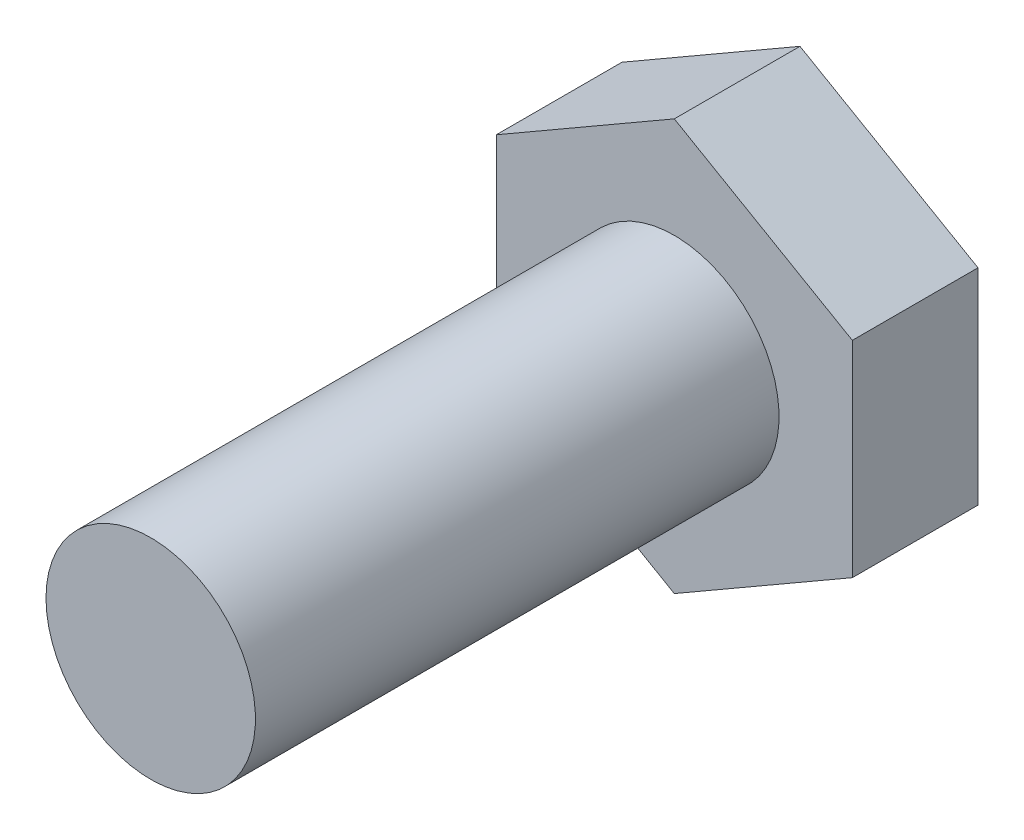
ISO-10303-21;
HEADER;
FILE_DESCRIPTION(('STEP AP214'),'2;1');
FILE_NAME('part.step','',(''),(''),'','','');
FILE_SCHEMA(('AUTOMOTIVE_DESIGN { 1 0 10303 214 1 1 1 1 }'));
ENDSEC;
DATA;
#1=APPLICATION_CONTEXT('core data for automotive mechanical design processes');
#2=APPLICATION_PROTOCOL_DEFINITION('international standard','automotive_design',2000,#1);
#3=PRODUCT_CONTEXT('',#1,'mechanical');
#4=PRODUCT('Part','Part','',(#3));
#5=PRODUCT_RELATED_PRODUCT_CATEGORY('part','',(#4));
#6=PRODUCT_DEFINITION_FORMATION('','',#4);
#7=PRODUCT_DEFINITION_CONTEXT('part definition',#1,'design');
#8=PRODUCT_DEFINITION('design','',#6,#7);
#9=PRODUCT_DEFINITION_SHAPE('','',#8);
#10=(LENGTH_UNIT() NAMED_UNIT(*) SI_UNIT(.MILLI.,.METRE.));
#11=(NAMED_UNIT(*) PLANE_ANGLE_UNIT() SI_UNIT($,.RADIAN.));
#12=(NAMED_UNIT(*) SI_UNIT($,.STERADIAN.) SOLID_ANGLE_UNIT());
#13=UNCERTAINTY_MEASURE_WITH_UNIT(LENGTH_MEASURE(1.E-05),#10,'distance_accuracy_value','');
#14=(GEOMETRIC_REPRESENTATION_CONTEXT(3) GLOBAL_UNCERTAINTY_ASSIGNED_CONTEXT((#13)) GLOBAL_UNIT_ASSIGNED_CONTEXT((#10,
#11,#12)) REPRESENTATION_CONTEXT('',''));
#15=CARTESIAN_POINT('',(0.,0.,0.));
#16=DIRECTION('',(0.,0.,1.));
#17=DIRECTION('',(1.,0.,0.));
#18=AXIS2_PLACEMENT_3D('',#15,#16,#17);
#19=CARTESIAN_POINT('',(0.,0.,32.5));
#20=DIRECTION('',(0.,0.,-1.));
#21=DIRECTION('',(-1.,0.,0.));
#22=AXIS2_PLACEMENT_3D('',#19,#20,#21);
#23=PLANE('',#22);
#24=CARTESIAN_POINT('',(0.,0.,32.5));
#25=DIRECTION('',(0.,0.,-1.));
#26=DIRECTION('',(-1.,0.,0.));
#27=AXIS2_PLACEMENT_3D('',#24,#25,#26);
#28=CIRCLE('',#27,5.);
#29=CARTESIAN_POINT('',(-5.,0.,32.5));
#30=VERTEX_POINT('',#29);
#31=EDGE_CURVE('E22',#30,#30,#28,.T.);
#32=ORIENTED_EDGE('',*,*,#31,.F.);
#33=EDGE_LOOP('',(#32));
#34=FACE_BOUND('',#33,.T.);
#35=ADVANCED_FACE('F15',(#34),#23,.F.);
#36=CARTESIAN_POINT('',(0.,0.,-37.5));
#37=DIRECTION('',(0.,0.,-1.));
#38=DIRECTION('',(-1.,0.,0.));
#39=AXIS2_PLACEMENT_3D('',#36,#37,#38);
#40=CYLINDRICAL_SURFACE('',#39,5.);
#41=CARTESIAN_POINT('',(0.,0.,7.5));
#42=DIRECTION('',(0.,0.,-1.));
#43=DIRECTION('',(-1.,0.,0.));
#44=AXIS2_PLACEMENT_3D('',#41,#42,#43);
#45=CIRCLE('',#44,5.);
#46=CARTESIAN_POINT('',(-5.,0.,7.5));
#47=VERTEX_POINT('',#46);
#48=EDGE_CURVE('E110',#47,#47,#45,.T.);
#49=ORIENTED_EDGE('',*,*,#48,.F.);
#50=EDGE_LOOP('',(#49));
#51=FACE_BOUND('',#50,.T.);
#52=ORIENTED_EDGE('',*,*,#31,.T.);
#53=EDGE_LOOP('',(#52));
#54=FACE_BOUND('',#53,.T.);
#55=ADVANCED_FACE('F115',(#51,#54),#40,.T.);
#56=CARTESIAN_POINT('',(-5.,0.,7.5));
#57=DIRECTION('',(0.,0.,-1.));
#58=DIRECTION('',(-1.,0.,0.));
#59=AXIS2_PLACEMENT_3D('',#56,#57,#58);
#60=PLANE('',#59);
#61=DIRECTION('',(0.866025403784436,-0.5,0.));
#62=VECTOR('',#61,1.);
#63=CARTESIAN_POINT('',(0.500000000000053,9.52627944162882,7.5));
#64=LINE('',#63,#62);
#65=CARTESIAN_POINT('',(0.,9.81495457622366,7.5));
#66=VERTEX_POINT('',#65);
#67=CARTESIAN_POINT('',(8.5,4.90747728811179,7.5));
#68=VERTEX_POINT('',#67);
#69=EDGE_CURVE('E81',#66,#68,#64,.T.);
#70=ORIENTED_EDGE('',*,*,#69,.F.);
#71=DIRECTION('',(-0.866025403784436,-0.5,0.));
#72=VECTOR('',#71,1.);
#73=CARTESIAN_POINT('',(-8.,5.1961524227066,7.5));
#74=LINE('',#73,#72);
#75=CARTESIAN_POINT('',(-8.5,4.90747728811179,7.5));
#76=VERTEX_POINT('',#75);
#77=EDGE_CURVE('E107',#66,#76,#74,.T.);
#78=ORIENTED_EDGE('',*,*,#77,.T.);
#79=DIRECTION('',(0.,-1.,0.));
#80=VECTOR('',#79,1.);
#81=CARTESIAN_POINT('',(-8.5,0.,7.5));
#82=LINE('',#81,#80);
#83=CARTESIAN_POINT('',(-8.5,-4.9074772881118,7.5));
#84=VERTEX_POINT('',#83);
#85=EDGE_CURVE('E104',#76,#84,#82,.T.);
#86=ORIENTED_EDGE('',*,*,#85,.T.);
#87=DIRECTION('',(-0.866025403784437,0.5,0.));
#88=VECTOR('',#87,1.);
#89=CARTESIAN_POINT('',(-8.,-5.19615242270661,7.5));
#90=LINE('',#89,#88);
#91=CARTESIAN_POINT('',(0.,-9.81495457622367,7.5));
#92=VERTEX_POINT('',#91);
#93=EDGE_CURVE('E102',#92,#84,#90,.T.);
#94=ORIENTED_EDGE('',*,*,#93,.F.);
#95=DIRECTION('',(0.866025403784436,0.5,0.));
#96=VECTOR('',#95,1.);
#97=CARTESIAN_POINT('',(0.500000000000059,-9.52627944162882,7.5));
#98=LINE('',#97,#96);
#99=CARTESIAN_POINT('',(8.5,-4.9074772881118,7.5));
#100=VERTEX_POINT('',#99);
#101=EDGE_CURVE('E99',#92,#100,#98,.T.);
#102=ORIENTED_EDGE('',*,*,#101,.T.);
#103=DIRECTION('',(0.,-1.,0.));
#104=VECTOR('',#103,1.);
#105=CARTESIAN_POINT('',(8.5,0.,7.5));
#106=LINE('',#105,#104);
#107=EDGE_CURVE('E97',#68,#100,#106,.T.);
#108=ORIENTED_EDGE('',*,*,#107,.F.);
#109=EDGE_LOOP('',(#70,#78,#86,#94,#102,#108));
#110=FACE_BOUND('',#109,.T.);
#111=ORIENTED_EDGE('',*,*,#48,.T.);
#112=EDGE_LOOP('',(#111));
#113=FACE_BOUND('',#112,.T.);
#114=ADVANCED_FACE('F122',(#110,#113),#60,.F.);
#115=CARTESIAN_POINT('',(0.,9.81495457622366,9.2));
#116=DIRECTION('',(0.5,-0.866025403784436,0.));
#117=DIRECTION('',(-0.866025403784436,-0.5,0.));
#118=AXIS2_PLACEMENT_3D('',#115,#116,#117);
#119=PLANE('',#118);
#120=DIRECTION('',(0.,0.,-1.));
#121=VECTOR('',#120,1.);
#122=CARTESIAN_POINT('',(0.,9.81495457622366,9.2));
#123=LINE('',#122,#121);
#124=CARTESIAN_POINT('',(0.,9.81495457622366,1.5));
#125=VERTEX_POINT('',#124);
#126=EDGE_CURVE('E35',#66,#125,#123,.T.);
#127=ORIENTED_EDGE('',*,*,#126,.T.);
#128=DIRECTION('',(-0.866025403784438,-0.5,0.));
#129=VECTOR('',#128,1.);
#130=CARTESIAN_POINT('',(0.,9.81495457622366,1.5));
#131=LINE('',#130,#129);
#132=CARTESIAN_POINT('',(-8.5,4.90747728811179,1.5));
#133=VERTEX_POINT('',#132);
#134=EDGE_CURVE('E28',#125,#133,#131,.T.);
#135=ORIENTED_EDGE('',*,*,#134,.T.);
#136=DIRECTION('',(0.,0.,-1.));
#137=VECTOR('',#136,1.);
#138=CARTESIAN_POINT('',(-8.5,4.90747728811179,9.2));
#139=LINE('',#138,#137);
#140=EDGE_CURVE('E93',#76,#133,#139,.T.);
#141=ORIENTED_EDGE('',*,*,#140,.F.);
#142=ORIENTED_EDGE('',*,*,#77,.F.);
#143=EDGE_LOOP('',(#127,#135,#141,#142));
#144=FACE_BOUND('',#143,.T.);
#145=ADVANCED_FACE('F127',(#144),#119,.F.);
#146=CARTESIAN_POINT('',(-8.5,4.90747728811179,9.2));
#147=DIRECTION('',(1.,0.,0.));
#148=DIRECTION('',(0.,-1.,0.));
#149=AXIS2_PLACEMENT_3D('',#146,#147,#148);
#150=PLANE('',#149);
#151=ORIENTED_EDGE('',*,*,#140,.T.);
#152=DIRECTION('',(0.,-1.,0.));
#153=VECTOR('',#152,1.);
#154=CARTESIAN_POINT('',(-8.5,4.90747728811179,1.5));
#155=LINE('',#154,#153);
#156=CARTESIAN_POINT('',(-8.5,-4.90747728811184,1.5));
#157=VERTEX_POINT('',#156);
#158=EDGE_CURVE('E174',#133,#157,#155,.T.);
#159=ORIENTED_EDGE('',*,*,#158,.T.);
#160=DIRECTION('',(0.,0.,-1.));
#161=VECTOR('',#160,1.);
#162=CARTESIAN_POINT('',(-8.5,-4.9074772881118,9.2));
#163=LINE('',#162,#161);
#164=EDGE_CURVE('E90',#84,#157,#163,.T.);
#165=ORIENTED_EDGE('',*,*,#164,.F.);
#166=ORIENTED_EDGE('',*,*,#85,.F.);
#167=EDGE_LOOP('',(#151,#159,#165,#166));
#168=FACE_BOUND('',#167,.T.);
#169=ADVANCED_FACE('F132',(#168),#150,.F.);
#170=CARTESIAN_POINT('',(0.,-9.81495457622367,9.2));
#171=DIRECTION('',(-0.5,-0.866025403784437,0.));
#172=DIRECTION('',(-0.866025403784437,0.5,0.));
#173=AXIS2_PLACEMENT_3D('',#170,#171,#172);
#174=PLANE('',#173);
#175=DIRECTION('',(-0.866025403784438,0.5,0.));
#176=VECTOR('',#175,1.);
#177=CARTESIAN_POINT('',(0.,-9.81495457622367,1.5));
#178=LINE('',#177,#176);
#179=CARTESIAN_POINT('',(0.,-9.81495457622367,1.5));
#180=VERTEX_POINT('',#179);
#181=EDGE_CURVE('E172',#180,#157,#178,.T.);
#182=ORIENTED_EDGE('',*,*,#181,.F.);
#183=DIRECTION('',(0.,0.,-1.));
#184=VECTOR('',#183,1.);
#185=CARTESIAN_POINT('',(0.,-9.81495457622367,9.2));
#186=LINE('',#185,#184);
#187=EDGE_CURVE('E83',#92,#180,#186,.T.);
#188=ORIENTED_EDGE('',*,*,#187,.F.);
#189=ORIENTED_EDGE('',*,*,#93,.T.);
#190=ORIENTED_EDGE('',*,*,#164,.T.);
#191=EDGE_LOOP('',(#182,#188,#189,#190));
#192=FACE_BOUND('',#191,.T.);
#193=ADVANCED_FACE('F135',(#192),#174,.T.);
#194=CARTESIAN_POINT('',(0.,-9.81495457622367,9.2));
#195=DIRECTION('',(-0.5,0.866025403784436,0.));
#196=DIRECTION('',(0.866025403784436,0.5,0.));
#197=AXIS2_PLACEMENT_3D('',#194,#195,#196);
#198=PLANE('',#197);
#199=ORIENTED_EDGE('',*,*,#187,.T.);
#200=DIRECTION('',(0.866025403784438,0.5,0.));
#201=VECTOR('',#200,1.);
#202=CARTESIAN_POINT('',(0.,-9.81495457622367,1.5));
#203=LINE('',#202,#201);
#204=CARTESIAN_POINT('',(8.5,-4.9074772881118,1.5));
#205=VERTEX_POINT('',#204);
#206=EDGE_CURVE('E76',#180,#205,#203,.T.);
#207=ORIENTED_EDGE('',*,*,#206,.T.);
#208=DIRECTION('',(0.,0.,-1.));
#209=VECTOR('',#208,1.);
#210=CARTESIAN_POINT('',(8.5,-4.9074772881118,9.2));
#211=LINE('',#210,#209);
#212=EDGE_CURVE('E75',#100,#205,#211,.T.);
#213=ORIENTED_EDGE('',*,*,#212,.F.);
#214=ORIENTED_EDGE('',*,*,#101,.F.);
#215=EDGE_LOOP('',(#199,#207,#213,#214));
#216=FACE_BOUND('',#215,.T.);
#217=ADVANCED_FACE('F139',(#216),#198,.F.);
#218=CARTESIAN_POINT('',(8.5,4.90747728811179,9.2));
#219=DIRECTION('',(1.,0.,0.));
#220=DIRECTION('',(0.,-1.,0.));
#221=AXIS2_PLACEMENT_3D('',#218,#219,#220);
#222=PLANE('',#221);
#223=DIRECTION('',(0.,-1.,0.));
#224=VECTOR('',#223,1.);
#225=CARTESIAN_POINT('',(8.5,4.90747728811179,1.5));
#226=LINE('',#225,#224);
#227=CARTESIAN_POINT('',(8.5,4.90747728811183,1.5));
#228=VERTEX_POINT('',#227);
#229=EDGE_CURVE('E65',#228,#205,#226,.T.);
#230=ORIENTED_EDGE('',*,*,#229,.F.);
#231=DIRECTION('',(0.,0.,-1.));
#232=VECTOR('',#231,1.);
#233=CARTESIAN_POINT('',(8.5,4.90747728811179,9.2));
#234=LINE('',#233,#232);
#235=EDGE_CURVE('E72',#68,#228,#234,.T.);
#236=ORIENTED_EDGE('',*,*,#235,.F.);
#237=ORIENTED_EDGE('',*,*,#107,.T.);
#238=ORIENTED_EDGE('',*,*,#212,.T.);
#239=EDGE_LOOP('',(#230,#236,#237,#238));
#240=FACE_BOUND('',#239,.T.);
#241=ADVANCED_FACE('F71',(#240),#222,.T.);
#242=CARTESIAN_POINT('',(0.,9.81495457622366,9.2));
#243=DIRECTION('',(0.5,0.866025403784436,0.));
#244=DIRECTION('',(0.866025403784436,-0.5,0.));
#245=AXIS2_PLACEMENT_3D('',#242,#243,#244);
#246=PLANE('',#245);
#247=DIRECTION('',(0.866025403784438,-0.5,0.));
#248=VECTOR('',#247,1.);
#249=CARTESIAN_POINT('',(0.,9.81495457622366,1.5));
#250=LINE('',#249,#248);
#251=EDGE_CURVE('E9',#125,#228,#250,.T.);
#252=ORIENTED_EDGE('',*,*,#251,.F.);
#253=ORIENTED_EDGE('',*,*,#126,.F.);
#254=ORIENTED_EDGE('',*,*,#69,.T.);
#255=ORIENTED_EDGE('',*,*,#235,.T.);
#256=EDGE_LOOP('',(#252,#253,#254,#255));
#257=FACE_BOUND('',#256,.T.);
#258=ADVANCED_FACE('F79',(#257),#246,.T.);
#259=CARTESIAN_POINT('',(0.,6.35,1.5));
#260=DIRECTION('',(0.,0.,1.));
#261=DIRECTION('',(1.,0.,0.));
#262=AXIS2_PLACEMENT_3D('',#259,#260,#261);
#263=PLANE('',#262);
#264=CARTESIAN_POINT('',(0.,0.,1.5));
#265=DIRECTION('',(0.,0.,1.));
#266=DIRECTION('',(1.,0.,0.));
#267=AXIS2_PLACEMENT_3D('',#264,#265,#266);
#268=CIRCLE('',#267,6.35);
#269=CARTESIAN_POINT('',(6.35,0.,1.5));
#270=VERTEX_POINT('',#269);
#271=EDGE_CURVE('E165',#270,#270,#268,.T.);
#272=ORIENTED_EDGE('',*,*,#271,.T.);
#273=EDGE_LOOP('',(#272));
#274=FACE_BOUND('',#273,.T.);
#275=ORIENTED_EDGE('',*,*,#251,.T.);
#276=ORIENTED_EDGE('',*,*,#229,.T.);
#277=ORIENTED_EDGE('',*,*,#206,.F.);
#278=ORIENTED_EDGE('',*,*,#181,.T.);
#279=ORIENTED_EDGE('',*,*,#158,.F.);
#280=ORIENTED_EDGE('',*,*,#134,.F.);
#281=EDGE_LOOP('',(#275,#276,#277,#278,#279,#280));
#282=FACE_BOUND('',#281,.T.);
#283=ADVANCED_FACE('F64',(#274,#282),#263,.F.);
#284=CARTESIAN_POINT('',(0.,0.,-7.5));
#285=DIRECTION('',(0.,0.,-1.));
#286=DIRECTION('',(-1.,0.,0.));
#287=AXIS2_PLACEMENT_3D('',#284,#285,#286);
#288=CYLINDRICAL_SURFACE('',#287,6.35);
#289=CARTESIAN_POINT('',(0.,0.,0.));
#290=DIRECTION('',(0.,0.,1.));
#291=DIRECTION('',(1.,0.,0.));
#292=AXIS2_PLACEMENT_3D('',#289,#290,#291);
#293=CIRCLE('',#292,6.35);
#294=CARTESIAN_POINT('',(6.35,0.,0.));
#295=VERTEX_POINT('',#294);
#296=EDGE_CURVE('E77',#295,#295,#293,.T.);
#297=ORIENTED_EDGE('',*,*,#296,.T.);
#298=EDGE_LOOP('',(#297));
#299=FACE_BOUND('',#298,.T.);
#300=ORIENTED_EDGE('',*,*,#271,.F.);
#301=EDGE_LOOP('',(#300));
#302=FACE_BOUND('',#301,.T.);
#303=ADVANCED_FACE('F151',(#299,#302),#288,.T.);
#304=CARTESIAN_POINT('',(0.,0.,0.));
#305=DIRECTION('',(0.,0.,1.));
#306=DIRECTION('',(1.,0.,0.));
#307=AXIS2_PLACEMENT_3D('',#304,#305,#306);
#308=PLANE('',#307);
#309=ORIENTED_EDGE('',*,*,#296,.F.);
#310=EDGE_LOOP('',(#309));
#311=FACE_BOUND('',#310,.T.);
#312=ADVANCED_FACE('F154',(#311),#308,.F.);
#313=CLOSED_SHELL('',(#35,#55,#114,#145,#169,#193,#217,#241,#258,#283,#303,#312));
#314=MANIFOLD_SOLID_BREP('B1',#313);
#315=ADVANCED_BREP_SHAPE_REPRESENTATION('',(#18,#314),#14);
#316=SHAPE_DEFINITION_REPRESENTATION(#9,#315);
ENDSEC;
END-ISO-10303-21;
